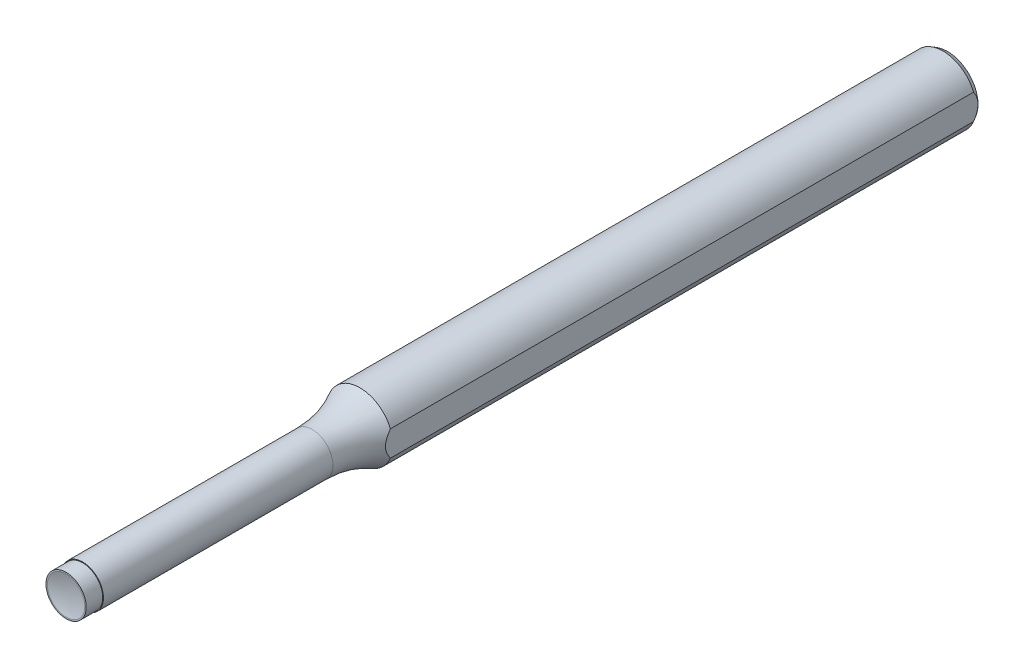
ISO-10303-21;
HEADER;
FILE_DESCRIPTION(('STEP AP214'),'2;1');
FILE_NAME('part.step','',(''),(''),'','','');
FILE_SCHEMA(('AUTOMOTIVE_DESIGN { 1 0 10303 214 1 1 1 1 }'));
ENDSEC;
DATA;
#1=APPLICATION_CONTEXT('core data for automotive mechanical design processes');
#2=APPLICATION_PROTOCOL_DEFINITION('international standard','automotive_design',2000,#1);
#3=PRODUCT_CONTEXT('',#1,'mechanical');
#4=PRODUCT('Part','Part','',(#3));
#5=PRODUCT_RELATED_PRODUCT_CATEGORY('part','',(#4));
#6=PRODUCT_DEFINITION_FORMATION('','',#4);
#7=PRODUCT_DEFINITION_CONTEXT('part definition',#1,'design');
#8=PRODUCT_DEFINITION('design','',#6,#7);
#9=PRODUCT_DEFINITION_SHAPE('','',#8);
#10=(LENGTH_UNIT() NAMED_UNIT(*) SI_UNIT(.MILLI.,.METRE.));
#11=(NAMED_UNIT(*) PLANE_ANGLE_UNIT() SI_UNIT($,.RADIAN.));
#12=(NAMED_UNIT(*) SI_UNIT($,.STERADIAN.) SOLID_ANGLE_UNIT());
#13=UNCERTAINTY_MEASURE_WITH_UNIT(LENGTH_MEASURE(1.E-05),#10,'distance_accuracy_value','');
#14=(GEOMETRIC_REPRESENTATION_CONTEXT(3) GLOBAL_UNCERTAINTY_ASSIGNED_CONTEXT((#13)) GLOBAL_UNIT_ASSIGNED_CONTEXT((#10,
#11,#12)) REPRESENTATION_CONTEXT('',''));
#15=CARTESIAN_POINT('',(0.,0.,0.));
#16=DIRECTION('',(0.,0.,1.));
#17=DIRECTION('',(1.,0.,0.));
#18=AXIS2_PLACEMENT_3D('',#15,#16,#17);
#19=CARTESIAN_POINT('',(0.,0.,-42.3333333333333));
#20=DIRECTION('',(0.,0.,1.));
#21=DIRECTION('',(1.,0.,0.));
#22=AXIS2_PLACEMENT_3D('',#19,#20,#21);
#23=CYLINDRICAL_SURFACE('',#22,3.);
#24=CARTESIAN_POINT('',(0.,0.,-35.4524812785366));
#25=DIRECTION('',(0.,0.,1.));
#26=DIRECTION('',(0.,-1.,0.));
#27=AXIS2_PLACEMENT_3D('',#24,#25,#26);
#28=CIRCLE('',#27,3.);
#29=CARTESIAN_POINT('',(0.,-3.,-35.4524812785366));
#30=VERTEX_POINT('',#29);
#31=EDGE_CURVE('E79',#30,#30,#28,.F.);
#32=ORIENTED_EDGE('',*,*,#31,.F.);
#33=EDGE_LOOP('',(#32));
#34=FACE_BOUND('',#33,.T.);
#35=CARTESIAN_POINT('',(0.,0.,-2.3825));
#36=DIRECTION('',(0.,0.,1.));
#37=DIRECTION('',(1.,0.,0.));
#38=AXIS2_PLACEMENT_3D('',#35,#36,#37);
#39=CIRCLE('',#38,3.);
#40=CARTESIAN_POINT('',(3.,0.,-2.3825));
#41=VERTEX_POINT('',#40);
#42=EDGE_CURVE('E90',#41,#41,#39,.F.);
#43=ORIENTED_EDGE('',*,*,#42,.T.);
#44=EDGE_LOOP('',(#43));
#45=FACE_BOUND('',#44,.T.);
#46=ADVANCED_FACE('F42',(#34,#45),#23,.T.);
#47=CARTESIAN_POINT('',(0.,0.,-2.3825));
#48=DIRECTION('',(0.,0.,1.));
#49=DIRECTION('',(1.,0.,0.));
#50=AXIS2_PLACEMENT_3D('',#47,#48,#49);
#51=PLANE('',#50);
#52=ORIENTED_EDGE('',*,*,#42,.F.);
#53=EDGE_LOOP('',(#52));
#54=FACE_BOUND('',#53,.T.);
#55=CARTESIAN_POINT('',(0.,0.,-2.3825));
#56=DIRECTION('',(0.,0.,1.));
#57=DIRECTION('',(1.,0.,0.));
#58=AXIS2_PLACEMENT_3D('',#55,#56,#57);
#59=CIRCLE('',#58,2.9);
#60=CARTESIAN_POINT('',(2.9,0.,-2.3825));
#61=VERTEX_POINT('',#60);
#62=EDGE_CURVE('E98',#61,#61,#59,.T.);
#63=ORIENTED_EDGE('',*,*,#62,.F.);
#64=EDGE_LOOP('',(#63));
#65=FACE_BOUND('',#64,.T.);
#66=ADVANCED_FACE('F111',(#54,#65),#51,.T.);
#67=CARTESIAN_POINT('',(0.,0.,-2.3825));
#68=DIRECTION('',(0.,0.,1.));
#69=DIRECTION('',(1.,0.,0.));
#70=AXIS2_PLACEMENT_3D('',#67,#68,#69);
#71=CYLINDRICAL_SURFACE('',#70,2.9);
#72=ORIENTED_EDGE('',*,*,#62,.T.);
#73=EDGE_LOOP('',(#72));
#74=FACE_BOUND('',#73,.T.);
#75=CARTESIAN_POINT('',(0.,0.,0.));
#76=DIRECTION('',(0.,0.,1.));
#77=DIRECTION('',(1.,0.,0.));
#78=AXIS2_PLACEMENT_3D('',#75,#76,#77);
#79=CIRCLE('',#78,2.9);
#80=CARTESIAN_POINT('',(2.9,0.,0.));
#81=VERTEX_POINT('',#80);
#82=EDGE_CURVE('E123',#81,#81,#79,.T.);
#83=ORIENTED_EDGE('',*,*,#82,.F.);
#84=EDGE_LOOP('',(#83));
#85=FACE_BOUND('',#84,.T.);
#86=ADVANCED_FACE('F117',(#74,#85),#71,.T.);
#87=CARTESIAN_POINT('',(0.,0.,0.));
#88=DIRECTION('',(0.,0.,1.));
#89=DIRECTION('',(1.,0.,0.));
#90=AXIS2_PLACEMENT_3D('',#87,#88,#89);
#91=PLANE('',#90);
#92=CARTESIAN_POINT('',(0.,0.,0.));
#93=DIRECTION('',(0.,0.,1.));
#94=DIRECTION('',(0.,-1.,0.));
#95=AXIS2_PLACEMENT_3D('',#92,#93,#94);
#96=CIRCLE('',#95,2.7);
#97=CARTESIAN_POINT('',(0.,-2.7,0.));
#98=VERTEX_POINT('',#97);
#99=EDGE_CURVE('E126',#98,#98,#96,.T.);
#100=ORIENTED_EDGE('',*,*,#99,.F.);
#101=EDGE_LOOP('',(#100));
#102=FACE_BOUND('',#101,.T.);
#103=ORIENTED_EDGE('',*,*,#82,.T.);
#104=EDGE_LOOP('',(#103));
#105=FACE_BOUND('',#104,.T.);
#106=ADVANCED_FACE('F157',(#102,#105),#91,.T.);
#107=CARTESIAN_POINT('',(0.,0.,9.13952405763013));
#108=DIRECTION('',(0.,0.,1.));
#109=DIRECTION('',(0.,1.,0.));
#110=AXIS2_PLACEMENT_3D('',#107,#108,#109);
#111=SPHERICAL_SURFACE('',#110,9.53);
#112=ORIENTED_EDGE('',*,*,#99,.T.);
#113=EDGE_LOOP('',(#112));
#114=FACE_BOUND('',#113,.T.);
#115=ADVANCED_FACE('F160',(#114),#111,.F.);
#116=CARTESIAN_POINT('',(0.,0.,-35.4524812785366));
#117=DIRECTION('',(0.,0.,-1.));
#118=DIRECTION('',(0.,1.,0.));
#119=AXIS2_PLACEMENT_3D('',#116,#117,#118);
#120=TOROIDAL_SURFACE('',#119,17.295,14.295);
#121=CARTESIAN_POINT('',(4.39819012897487,9.63038389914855,-48.0759581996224));
#122=CARTESIAN_POINT('',(4.39819012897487,9.45285161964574,-47.990150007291));
#123=CARTESIAN_POINT('',(4.39819012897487,9.27673395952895,-47.9014549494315));
#124=CARTESIAN_POINT('',(4.39819012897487,8.9274058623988,-47.7185506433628));
#125=CARTESIAN_POINT('',(4.39819012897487,8.75419514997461,-47.6243419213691));
#126=CARTESIAN_POINT('',(4.39819012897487,8.23934657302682,-47.3340101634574));
#127=CARTESIAN_POINT('',(4.39819012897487,7.9021234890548,-47.1300023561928));
#128=CARTESIAN_POINT('',(4.39819012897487,7.24327467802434,-46.7056612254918));
#129=CARTESIAN_POINT('',(4.39819012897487,6.92152098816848,-46.4855251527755));
#130=CARTESIAN_POINT('',(4.39819012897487,6.28923005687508,-46.0296393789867));
#131=CARTESIAN_POINT('',(4.39819012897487,5.97869479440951,-45.7938869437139));
#132=CARTESIAN_POINT('',(4.39819012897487,5.4624177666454,-45.3851836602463));
#133=CARTESIAN_POINT('',(4.39819012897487,5.25408716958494,-45.2154720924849));
#134=CARTESIAN_POINT('',(4.39819012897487,4.84126549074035,-44.8714782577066));
#135=CARTESIAN_POINT('',(4.39819012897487,4.63677417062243,-44.6971962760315));
#136=CARTESIAN_POINT('',(4.39819012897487,4.22966227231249,-44.3450270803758));
#137=CARTESIAN_POINT('',(4.39819012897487,4.02705095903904,-44.1671292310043));
#138=CARTESIAN_POINT('',(4.39819012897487,3.72366011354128,-43.8997216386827));
#139=CARTESIAN_POINT('',(4.39819012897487,3.62262535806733,-43.8104992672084));
#140=CARTESIAN_POINT('',(4.39819012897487,3.42037948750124,-43.6322405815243));
#141=CARTESIAN_POINT('',(4.39819012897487,3.31916836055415,-43.5432042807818));
#142=CARTESIAN_POINT('',(4.39819012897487,3.0757355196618,-43.3304233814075));
#143=CARTESIAN_POINT('',(4.39819012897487,2.93324279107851,-43.2069859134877));
#144=CARTESIAN_POINT('',(4.39819012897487,2.64572792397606,-42.963125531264));
#145=CARTESIAN_POINT('',(4.39819012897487,2.50070620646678,-42.8427021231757));
#146=CARTESIAN_POINT('',(4.39819012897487,2.20643030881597,-42.6077354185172));
#147=CARTESIAN_POINT('',(4.39819012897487,2.05718684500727,-42.4931790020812));
#148=CARTESIAN_POINT('',(4.39819012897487,1.82796935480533,-42.3289256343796));
#149=CARTESIAN_POINT('',(4.39819012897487,1.75070847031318,-42.2754610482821));
#150=CARTESIAN_POINT('',(4.39819012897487,1.59397965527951,-42.1718876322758));
#151=CARTESIAN_POINT('',(4.39819012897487,1.51451229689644,-42.1217779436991));
#152=CARTESIAN_POINT('',(4.39819012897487,1.36846117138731,-42.0351730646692));
#153=CARTESIAN_POINT('',(4.39819012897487,1.30233583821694,-41.9979119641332));
#154=CARTESIAN_POINT('',(4.39819012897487,1.16818381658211,-41.9269958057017));
#155=CARTESIAN_POINT('',(4.39819012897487,1.10015689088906,-41.8933412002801));
#156=CARTESIAN_POINT('',(4.39819012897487,0.893195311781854,-41.7991780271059));
#157=CARTESIAN_POINT('',(4.39819012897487,0.751051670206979,-41.7452660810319));
#158=CARTESIAN_POINT('',(4.39819012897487,0.48556784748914,-41.6708924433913));
#159=CARTESIAN_POINT('',(4.39819012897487,0.363462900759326,-41.6461502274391));
#160=CARTESIAN_POINT('',(4.39819012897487,0.116820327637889,-41.6181409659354));
#161=CARTESIAN_POINT('',(4.39819012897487,-0.00771420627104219,-41.6148482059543));
#162=CARTESIAN_POINT('',(4.39819012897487,-0.255251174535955,-41.6302922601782));
#163=CARTESIAN_POINT('',(4.39819012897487,-0.378254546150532,-41.6490148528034));
#164=CARTESIAN_POINT('',(4.39819012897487,-0.619799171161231,-41.7052709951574));
#165=CARTESIAN_POINT('',(4.39819012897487,-0.738335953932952,-41.742822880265));
#166=CARTESIAN_POINT('',(4.39819012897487,-0.986180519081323,-41.8383703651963));
#167=CARTESIAN_POINT('',(4.39819012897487,-1.11463686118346,-41.8985078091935));
#168=CARTESIAN_POINT('',(4.39819012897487,-1.36503393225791,-42.0312444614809));
#169=CARTESIAN_POINT('',(4.39819012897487,-1.48696171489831,-42.1038673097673));
#170=CARTESIAN_POINT('',(4.39819012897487,-1.72665480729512,-42.2580110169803));
#171=CARTESIAN_POINT('',(4.39819012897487,-1.84436786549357,-42.3396118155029));
#172=CARTESIAN_POINT('',(4.39819012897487,-2.01787015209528,-42.4660520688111));
#173=CARTESIAN_POINT('',(4.39819012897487,-2.07517156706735,-42.5088547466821));
#174=CARTESIAN_POINT('',(4.39819012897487,-2.18892571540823,-42.595569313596));
#175=CARTESIAN_POINT('',(4.39819012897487,-2.24537849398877,-42.6394811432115));
#176=CARTESIAN_POINT('',(4.39819012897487,-2.42427558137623,-42.7809106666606));
#177=CARTESIAN_POINT('',(4.39819012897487,-2.54539437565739,-42.8801008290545));
#178=CARTESIAN_POINT('',(4.39819012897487,-2.78552238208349,-43.0810091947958));
#179=CARTESIAN_POINT('',(4.39819012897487,-2.90453129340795,-43.1827277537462));
#180=CARTESIAN_POINT('',(4.39819012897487,-3.14141085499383,-43.3875736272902));
#181=CARTESIAN_POINT('',(4.39819012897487,-3.25928102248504,-43.4907014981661));
#182=CARTESIAN_POINT('',(4.39819012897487,-3.49455665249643,-43.6974873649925));
#183=CARTESIAN_POINT('',(4.39819012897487,-3.61196210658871,-43.8011453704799));
#184=CARTESIAN_POINT('',(4.39819012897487,-3.84699950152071,-44.0084762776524));
#185=CARTESIAN_POINT('',(4.39819012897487,-3.96463154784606,-44.1121490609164));
#186=CARTESIAN_POINT('',(4.39819012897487,-4.20042065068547,-44.3188952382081));
#187=CARTESIAN_POINT('',(4.39819012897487,-4.31857770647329,-44.4219686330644));
#188=CARTESIAN_POINT('',(4.39819012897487,-4.67431483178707,-44.7296176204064));
#189=CARTESIAN_POINT('',(4.39819012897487,-4.91321976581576,-44.9326747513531));
#190=CARTESIAN_POINT('',(4.39819012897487,-5.39409431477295,-45.3302076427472));
#191=CARTESIAN_POINT('',(4.39819012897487,-5.63600955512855,-45.5247488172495));
#192=CARTESIAN_POINT('',(4.39819012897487,-6.12636347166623,-45.905519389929));
#193=CARTESIAN_POINT('',(4.39819012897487,-6.37480282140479,-46.0917479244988));
#194=CARTESIAN_POINT('',(4.39819012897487,-6.8786694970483,-46.4541822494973));
#195=CARTESIAN_POINT('',(4.39819012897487,-7.13409234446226,-46.6303942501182));
#196=CARTESIAN_POINT('',(4.39819012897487,-7.65232955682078,-46.9715384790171));
#197=CARTESIAN_POINT('',(4.39819012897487,-7.9151424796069,-47.1364728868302));
#198=CARTESIAN_POINT('',(4.39819012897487,-8.29909369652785,-47.3651009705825));
#199=CARTESIAN_POINT('',(4.39819012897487,-8.41725758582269,-47.4338239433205));
#200=CARTESIAN_POINT('',(4.39819012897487,-8.65500133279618,-47.5687510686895));
#201=CARTESIAN_POINT('',(4.39819012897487,-8.77458103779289,-47.6349554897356));
#202=CARTESIAN_POINT('',(4.39819012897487,-9.016034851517,-47.765238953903));
#203=CARTESIAN_POINT('',(4.39819012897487,-9.13791938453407,-47.829298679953));
#204=CARTESIAN_POINT('',(4.39819012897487,-9.3831025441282,-47.9546953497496));
#205=CARTESIAN_POINT('',(4.39819012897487,-9.50640136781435,-48.0160319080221));
#206=CARTESIAN_POINT('',(4.39819012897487,-9.63038389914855,-48.0759581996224));
#207=B_SPLINE_CURVE_WITH_KNOTS('',3,(#121,#122,#123,#124,#125,#126,#127,#128,#129,#130,#131,
#132,#133,#134,#135,#136,#137,#138,#139,#140,#141,#142,#143,#144,#145,#146,#147,#148,#149,#150,
#151,#152,#153,#154,#155,#156,#157,#158,#159,#160,#161,#162,#163,#164,#165,#166,#167,#168,#169,
#170,#171,#172,#173,#174,#175,#176,#177,#178,#179,#180,#181,#182,#183,#184,#185,#186,#187,#188,
#189,#190,#191,#192,#193,#194,#195,#196,#197,#198,#199,#200,#201,#202,#203,#204,#205,#206),
.UNSPECIFIED.,.F.,.F.,(4,2,2,2,2,2,2,2,2,2,2,2,2,2,2,2,2,2,2,2,2,2,2,2,2,2,2,2,2,2,2,2,2,2,2,2,
2,2,2,2,2,2,4),(0.,0.591488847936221,1.18292133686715,2.36455846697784,3.53359716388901,
4.7028410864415,5.5088918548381,6.31489241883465,7.12376559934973,7.52813928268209,
7.93254128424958,8.49808881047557,9.06354307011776,9.62767206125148,9.90947582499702,
10.1912071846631,10.4188046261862,10.646430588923,11.1005297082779,11.4726893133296,
11.8444026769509,12.2158760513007,12.5877118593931,13.0121977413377,13.4374963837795,
13.8669466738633,14.0815067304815,14.296055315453,14.7656423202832,15.2352957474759,
15.7051402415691,16.1749932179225,16.6453832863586,17.1157727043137,18.0563143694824,
18.9874701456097,19.9187224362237,20.849390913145,21.7798790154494,22.1899401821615,
22.5999575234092,23.0130042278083,23.4261092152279),.UNSPECIFIED.);
#208=CARTESIAN_POINT('',(4.39819012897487,1.83334355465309,-42.3333333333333));
#209=VERTEX_POINT('',#208);
#210=CARTESIAN_POINT('',(4.39819012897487,-1.83334355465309,-42.3333333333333));
#211=VERTEX_POINT('',#210);
#212=EDGE_CURVE('E58',#209,#211,#207,.T.);
#213=ORIENTED_EDGE('',*,*,#212,.F.);
#214=CARTESIAN_POINT('',(0.,0.,-42.3333333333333));
#215=DIRECTION('',(0.,0.,-1.));
#216=DIRECTION('',(0.,1.,0.));
#217=AXIS2_PLACEMENT_3D('',#214,#215,#216);
#218=CIRCLE('',#217,4.765);
#219=EDGE_CURVE('E130',#211,#209,#218,.T.);
#220=ORIENTED_EDGE('',*,*,#219,.F.);
#221=EDGE_LOOP('',(#213,#220));
#222=FACE_BOUND('',#221,.T.);
#223=ORIENTED_EDGE('',*,*,#31,.T.);
#224=EDGE_LOOP('',(#223));
#225=FACE_BOUND('',#224,.T.);
#226=ADVANCED_FACE('F107',(#222,#225),#120,.F.);
#227=CARTESIAN_POINT('',(0.,0.,-127.));
#228=DIRECTION('',(0.,0.,1.));
#229=DIRECTION('',(1.,0.,0.));
#230=AXIS2_PLACEMENT_3D('',#227,#228,#229);
#231=PLANE('',#230);
#232=CARTESIAN_POINT('',(0.,0.,-127.));
#233=DIRECTION('',(0.,0.,1.));
#234=DIRECTION('',(1.,0.,0.));
#235=AXIS2_PLACEMENT_3D('',#232,#233,#234);
#236=CIRCLE('',#235,4.39819012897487);
#237=CARTESIAN_POINT('',(4.39819012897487,0.,-127.));
#238=VERTEX_POINT('',#237);
#239=EDGE_CURVE('E85',#238,#238,#236,.F.);
#240=ORIENTED_EDGE('',*,*,#239,.T.);
#241=EDGE_LOOP('',(#240));
#242=FACE_BOUND('',#241,.T.);
#243=ADVANCED_FACE('F155',(#242),#231,.F.);
#244=CARTESIAN_POINT('',(0.,0.,-126.364666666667));
#245=DIRECTION('',(0.,0.,1.));
#246=DIRECTION('',(1.,0.,0.));
#247=AXIS2_PLACEMENT_3D('',#244,#245,#246);
#248=CONICAL_SURFACE('',#247,4.765,0.523598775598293);
#249=CARTESIAN_POINT('',(4.39819012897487,-5.33423797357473,-122.64314394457));
#250=CARTESIAN_POINT('',(4.39819012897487,-5.23964449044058,-122.769540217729));
#251=CARTESIAN_POINT('',(4.39819012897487,-5.14441079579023,-122.895461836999));
#252=CARTESIAN_POINT('',(4.39819012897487,-4.95244135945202,-123.14617446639));
#253=CARTESIAN_POINT('',(4.39819012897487,-4.85570546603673,-123.270965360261));
#254=CARTESIAN_POINT('',(4.39819012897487,-4.66025992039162,-123.519551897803));
#255=CARTESIAN_POINT('',(4.39819012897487,-4.56154555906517,-123.643343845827));
#256=CARTESIAN_POINT('',(4.39819012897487,-4.36213663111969,-123.889318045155));
#257=CARTESIAN_POINT('',(4.39819012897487,-4.26144213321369,-124.01150035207));
#258=CARTESIAN_POINT('',(4.39819012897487,-4.05667136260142,-124.255205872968));
#259=CARTESIAN_POINT('',(4.39819012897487,-3.95257064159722,-124.376708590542));
#260=CARTESIAN_POINT('',(4.39819012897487,-3.74160194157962,-124.617285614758));
#261=CARTESIAN_POINT('',(4.39819012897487,-3.63473408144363,-124.73636002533));
#262=CARTESIAN_POINT('',(4.39819012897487,-3.41782749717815,-124.971366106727));
#263=CARTESIAN_POINT('',(4.39819012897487,-3.30779217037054,-125.087300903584));
#264=CARTESIAN_POINT('',(4.39819012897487,-3.08382779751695,-125.315332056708));
#265=CARTESIAN_POINT('',(4.39819012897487,-2.96989944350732,-125.427429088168));
#266=CARTESIAN_POINT('',(4.39819012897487,-2.77186488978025,-125.614120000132));
#267=CARTESIAN_POINT('',(4.39819012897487,-2.68894403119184,-125.68996971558));
#268=CARTESIAN_POINT('',(4.39819012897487,-2.52044667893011,-125.838685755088));
#269=CARTESIAN_POINT('',(4.39819012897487,-2.43486999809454,-125.911551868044));
#270=CARTESIAN_POINT('',(4.39819012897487,-2.26054924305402,-126.053736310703));
#271=CARTESIAN_POINT('',(4.39819012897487,-2.17179979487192,-126.123048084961));
#272=CARTESIAN_POINT('',(4.39819012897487,-1.99088174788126,-126.257087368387));
#273=CARTESIAN_POINT('',(4.39819012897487,-1.89871312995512,-126.321814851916));
#274=CARTESIAN_POINT('',(4.39819012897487,-1.7090542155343,-126.446513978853));
#275=CARTESIAN_POINT('',(4.39819012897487,-1.61150226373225,-126.506392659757));
#276=CARTESIAN_POINT('',(4.39819012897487,-1.41210644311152,-126.618657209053));
#277=CARTESIAN_POINT('',(4.39819012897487,-1.31026180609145,-126.671041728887));
#278=CARTESIAN_POINT('',(4.39819012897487,-1.10269294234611,-126.766129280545));
#279=CARTESIAN_POINT('',(4.39819012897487,-0.996989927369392,-126.808878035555));
#280=CARTESIAN_POINT('',(4.39819012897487,-0.781614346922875,-126.882793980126));
#281=CARTESIAN_POINT('',(4.39819012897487,-0.67194529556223,-126.913971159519));
#282=CARTESIAN_POINT('',(4.39819012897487,-0.488020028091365,-126.954270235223));
#283=CARTESIAN_POINT('',(4.39819012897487,-0.414608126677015,-126.967290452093));
#284=CARTESIAN_POINT('',(4.39819012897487,-0.266950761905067,-126.987044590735));
#285=CARTESIAN_POINT('',(4.39819012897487,-0.192705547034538,-126.993780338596));
#286=CARTESIAN_POINT('',(4.39819012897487,-0.0439156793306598,-127.000708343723));
#287=CARTESIAN_POINT('',(4.39819012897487,0.0306289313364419,-127.000901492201));
#288=CARTESIAN_POINT('',(4.39819012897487,0.179435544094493,-126.994754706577));
#289=CARTESIAN_POINT('',(4.39819012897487,0.253697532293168,-126.988414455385));
#290=CARTESIAN_POINT('',(4.39819012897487,0.474629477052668,-126.959962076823));
#291=CARTESIAN_POINT('',(4.39819012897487,0.620159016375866,-126.928448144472));
#292=CARTESIAN_POINT('',(4.39819012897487,0.904823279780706,-126.844288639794));
#293=CARTESIAN_POINT('',(4.39819012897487,1.04395187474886,-126.791623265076));
#294=CARTESIAN_POINT('',(4.39819012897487,1.30222792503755,-126.675763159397));
#295=CARTESIAN_POINT('',(4.39819012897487,1.42203206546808,-126.61399704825));
#296=CARTESIAN_POINT('',(4.39819012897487,1.65585339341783,-126.480248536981));
#297=CARTESIAN_POINT('',(4.39819012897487,1.76986529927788,-126.40825703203));
#298=CARTESIAN_POINT('',(4.39819012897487,1.99362460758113,-126.255843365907));
#299=CARTESIAN_POINT('',(4.39819012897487,2.10332163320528,-126.175348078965));
#300=CARTESIAN_POINT('',(4.39819012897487,2.31795882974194,-126.008389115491));
#301=CARTESIAN_POINT('',(4.39819012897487,2.42290098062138,-125.921927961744));
#302=CARTESIAN_POINT('',(4.39819012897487,2.66383353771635,-125.714113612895));
#303=CARTESIAN_POINT('',(4.39819012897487,2.79822037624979,-125.590909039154));
#304=CARTESIAN_POINT('',(4.39819012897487,3.0611757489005,-125.338408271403));
#305=CARTESIAN_POINT('',(4.39819012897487,3.18974214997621,-125.209109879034));
#306=CARTESIAN_POINT('',(4.39819012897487,3.44236417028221,-124.945697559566));
#307=CARTESIAN_POINT('',(4.39819012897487,3.56641012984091,-124.811574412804));
#308=CARTESIAN_POINT('',(4.39819012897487,3.81058734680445,-124.539807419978));
#309=CARTESIAN_POINT('',(4.39819012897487,3.93071829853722,-124.402163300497));
#310=CARTESIAN_POINT('',(4.39819012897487,4.16130930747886,-124.131643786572));
#311=CARTESIAN_POINT('',(4.39819012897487,4.27194072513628,-123.998913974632));
#312=CARTESIAN_POINT('',(4.39819012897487,4.49075134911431,-123.731440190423));
#313=CARTESIAN_POINT('',(4.39819012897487,4.59893042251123,-123.59669610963));
#314=CARTESIAN_POINT('',(4.39819012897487,4.81265144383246,-123.326247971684));
#315=CARTESIAN_POINT('',(4.39819012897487,4.91820400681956,-123.190552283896));
#316=CARTESIAN_POINT('',(4.39819012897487,5.12750213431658,-122.917805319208));
#317=CARTESIAN_POINT('',(4.39819012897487,5.23124796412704,-122.780754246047));
#318=CARTESIAN_POINT('',(4.39819012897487,5.33423797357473,-122.64314394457));
#319=B_SPLINE_CURVE_WITH_KNOTS('',3,(#249,#250,#251,#252,#253,#254,#255,#256,#257,#258,#259,
#260,#261,#262,#263,#264,#265,#266,#267,#268,#269,#270,#271,#272,#273,#274,#275,#276,#277,#278,
#279,#280,#281,#282,#283,#284,#285,#286,#287,#288,#289,#290,#291,#292,#293,#294,#295,#296,#297,
#298,#299,#300,#301,#302,#303,#304,#305,#306,#307,#308,#309,#310,#311,#312,#313,#314,#315,#316,
#317,#318),.UNSPECIFIED.,.F.,.F.,(4,2,2,2,2,2,2,2,2,2,2,2,2,2,2,2,2,2,2,2,2,2,2,2,2,2,2,2,2,2,2,
2,2,2,4),(0.,0.473622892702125,0.947293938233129,1.42227179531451,1.89723319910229,
2.37719719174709,2.85714059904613,3.33658712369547,3.81594885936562,4.15302867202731,
4.49013229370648,4.82783680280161,5.16554320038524,5.50866767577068,5.85185381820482,
6.19337550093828,6.53460165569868,6.75803376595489,6.98140093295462,7.20473767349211,
7.42808525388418,7.87266697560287,8.31766589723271,8.72141386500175,9.12552361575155,
9.53344563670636,9.94119620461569,10.4878713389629,11.0347452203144,11.5827263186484,
12.1307500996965,12.6490872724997,13.1674524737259,13.6831809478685,14.1988330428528),.UNSPECIFIED.);
#320=CARTESIAN_POINT('',(4.39819012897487,-1.83334355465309,-126.364666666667));
#321=VERTEX_POINT('',#320);
#322=EDGE_CURVE('E73',#321,#238,#319,.T.);
#323=ORIENTED_EDGE('',*,*,#322,.F.);
#324=CARTESIAN_POINT('',(0.,0.,-126.364666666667));
#325=DIRECTION('',(0.,0.,1.));
#326=DIRECTION('',(1.,0.,0.));
#327=AXIS2_PLACEMENT_3D('',#324,#325,#326);
#328=CIRCLE('',#327,4.765);
#329=CARTESIAN_POINT('',(4.39819012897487,1.83334355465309,-126.364666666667));
#330=VERTEX_POINT('',#329);
#331=EDGE_CURVE('E83',#330,#321,#328,.T.);
#332=ORIENTED_EDGE('',*,*,#331,.F.);
#333=EDGE_CURVE('E64',#238,#330,#319,.T.);
#334=ORIENTED_EDGE('',*,*,#333,.F.);
#335=ORIENTED_EDGE('',*,*,#239,.F.);
#336=EDGE_LOOP('',(#323,#332,#334,#335));
#337=FACE_BOUND('',#336,.T.);
#338=ADVANCED_FACE('F44',(#337),#248,.T.);
#339=CARTESIAN_POINT('',(0.,0.,-127.));
#340=DIRECTION('',(0.,0.,1.));
#341=DIRECTION('',(1.,0.,0.));
#342=AXIS2_PLACEMENT_3D('',#339,#340,#341);
#343=CYLINDRICAL_SURFACE('',#342,4.765);
#344=DIRECTION('',(0.,0.,1.));
#345=VECTOR('',#344,1.);
#346=CARTESIAN_POINT('',(4.39819012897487,1.83334355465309,-127.));
#347=LINE('',#346,#345);
#348=EDGE_CURVE('E13',#330,#209,#347,.T.);
#349=ORIENTED_EDGE('',*,*,#348,.F.);
#350=ORIENTED_EDGE('',*,*,#331,.T.);
#351=DIRECTION('',(0.,0.,1.));
#352=VECTOR('',#351,1.);
#353=CARTESIAN_POINT('',(4.39819012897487,-1.83334355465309,-127.));
#354=LINE('',#353,#352);
#355=EDGE_CURVE('E52',#211,#321,#354,.F.);
#356=ORIENTED_EDGE('',*,*,#355,.F.);
#357=ORIENTED_EDGE('',*,*,#219,.T.);
#358=EDGE_LOOP('',(#349,#350,#356,#357));
#359=FACE_BOUND('',#358,.T.);
#360=ADVANCED_FACE('F88',(#359),#343,.T.);
#361=CARTESIAN_POINT('',(4.39819012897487,1.83334355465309,0.));
#362=DIRECTION('',(-1.,0.,0.));
#363=DIRECTION('',(0.,0.,1.));
#364=AXIS2_PLACEMENT_3D('',#361,#362,#363);
#365=PLANE('',#364);
#366=ORIENTED_EDGE('',*,*,#212,.T.);
#367=ORIENTED_EDGE('',*,*,#355,.T.);
#368=ORIENTED_EDGE('',*,*,#322,.T.);
#369=ORIENTED_EDGE('',*,*,#333,.T.);
#370=ORIENTED_EDGE('',*,*,#348,.T.);
#371=EDGE_LOOP('',(#366,#367,#368,#369,#370));
#372=FACE_BOUND('',#371,.T.);
#373=ADVANCED_FACE('F72',(#372),#365,.F.);
#374=CLOSED_SHELL('',(#46,#66,#86,#106,#115,#226,#243,#338,#360,#373));
#375=MANIFOLD_SOLID_BREP('B2',#374);
#376=ADVANCED_BREP_SHAPE_REPRESENTATION('',(#18,#375),#14);
#377=SHAPE_DEFINITION_REPRESENTATION(#9,#376);
ENDSEC;
END-ISO-10303-21;
